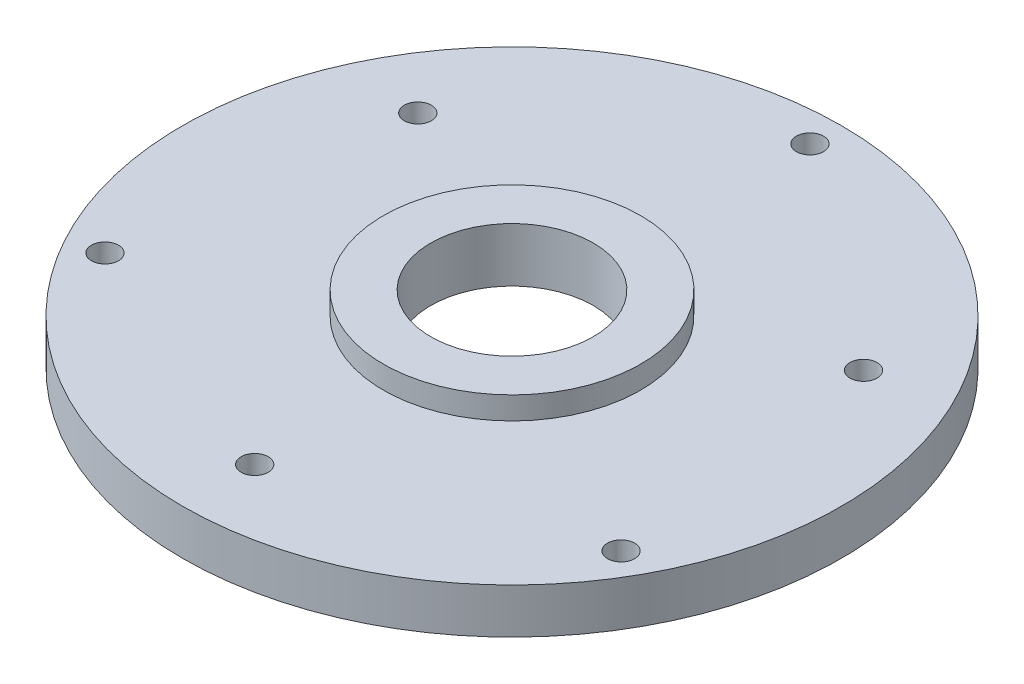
ISO-10303-21;
HEADER;
FILE_DESCRIPTION(('STEP AP214'),'2;1');
FILE_NAME('part.step','',(''),(''),'','','');
FILE_SCHEMA(('AUTOMOTIVE_DESIGN { 1 0 10303 214 1 1 1 1 }'));
ENDSEC;
DATA;
#1=APPLICATION_CONTEXT('core data for automotive mechanical design processes');
#2=APPLICATION_PROTOCOL_DEFINITION('international standard','automotive_design',2000,#1);
#3=PRODUCT_CONTEXT('',#1,'mechanical');
#4=PRODUCT('Part','Part','',(#3));
#5=PRODUCT_RELATED_PRODUCT_CATEGORY('part','',(#4));
#6=PRODUCT_DEFINITION_FORMATION('','',#4);
#7=PRODUCT_DEFINITION_CONTEXT('part definition',#1,'design');
#8=PRODUCT_DEFINITION('design','',#6,#7);
#9=PRODUCT_DEFINITION_SHAPE('','',#8);
#10=(LENGTH_UNIT() NAMED_UNIT(*) SI_UNIT(.MILLI.,.METRE.));
#11=(NAMED_UNIT(*) PLANE_ANGLE_UNIT() SI_UNIT($,.RADIAN.));
#12=(NAMED_UNIT(*) SI_UNIT($,.STERADIAN.) SOLID_ANGLE_UNIT());
#13=UNCERTAINTY_MEASURE_WITH_UNIT(LENGTH_MEASURE(1.E-05),#10,'distance_accuracy_value','');
#14=(GEOMETRIC_REPRESENTATION_CONTEXT(3) GLOBAL_UNCERTAINTY_ASSIGNED_CONTEXT((#13)) GLOBAL_UNIT_ASSIGNED_CONTEXT((#10,
#11,#12)) REPRESENTATION_CONTEXT('',''));
#15=CARTESIAN_POINT('',(0.,0.,0.));
#16=DIRECTION('',(0.,0.,1.));
#17=DIRECTION('',(1.,0.,0.));
#18=AXIS2_PLACEMENT_3D('',#15,#16,#17);
#19=CARTESIAN_POINT('',(0.,0.,0.));
#20=DIRECTION('',(0.,-1.,0.));
#21=DIRECTION('',(0.,0.,-1.));
#22=AXIS2_PLACEMENT_3D('',#19,#20,#21);
#23=CYLINDRICAL_SURFACE('',#22,14.25);
#24=CARTESIAN_POINT('',(0.,41.8859311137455,0.));
#25=DIRECTION('',(0.,-1.,0.));
#26=DIRECTION('',(0.,0.,-1.));
#27=AXIS2_PLACEMENT_3D('',#24,#25,#26);
#28=CIRCLE('',#27,14.25);
#29=CARTESIAN_POINT('',(0.,41.8859311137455,-14.25));
#30=VERTEX_POINT('',#29);
#31=EDGE_CURVE('E10',#30,#30,#28,.T.);
#32=ORIENTED_EDGE('',*,*,#31,.T.);
#33=EDGE_LOOP('',(#32));
#34=FACE_BOUND('',#33,.T.);
#35=CARTESIAN_POINT('',(0.,39.3859311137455,0.));
#36=DIRECTION('',(0.,-1.,0.));
#37=DIRECTION('',(0.,0.,-1.));
#38=AXIS2_PLACEMENT_3D('',#35,#36,#37);
#39=CIRCLE('',#38,14.25);
#40=CARTESIAN_POINT('',(0.,39.3859311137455,-14.25));
#41=VERTEX_POINT('',#40);
#42=EDGE_CURVE('E76',#41,#41,#39,.T.);
#43=ORIENTED_EDGE('',*,*,#42,.F.);
#44=EDGE_LOOP('',(#43));
#45=FACE_BOUND('',#44,.T.);
#46=ADVANCED_FACE('F39',(#34,#45),#23,.T.);
#47=CARTESIAN_POINT('',(9.,41.8859311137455,0.));
#48=DIRECTION('',(0.,1.,0.));
#49=DIRECTION('',(0.,0.,1.));
#50=AXIS2_PLACEMENT_3D('',#47,#48,#49);
#51=PLANE('',#50);
#52=CARTESIAN_POINT('',(0.,41.8859311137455,0.));
#53=DIRECTION('',(0.,-1.,0.));
#54=DIRECTION('',(0.,0.,-1.));
#55=AXIS2_PLACEMENT_3D('',#52,#53,#54);
#56=CIRCLE('',#55,9.);
#57=CARTESIAN_POINT('',(0.,41.8859311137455,-9.));
#58=VERTEX_POINT('',#57);
#59=EDGE_CURVE('E46',#58,#58,#56,.T.);
#60=ORIENTED_EDGE('',*,*,#59,.T.);
#61=EDGE_LOOP('',(#60));
#62=FACE_BOUND('',#61,.T.);
#63=ORIENTED_EDGE('',*,*,#31,.F.);
#64=EDGE_LOOP('',(#63));
#65=FACE_BOUND('',#64,.T.);
#66=ADVANCED_FACE('F109',(#62,#65),#51,.T.);
#67=CARTESIAN_POINT('',(0.,0.,0.));
#68=DIRECTION('',(0.,-1.,0.));
#69=DIRECTION('',(0.,0.,-1.));
#70=AXIS2_PLACEMENT_3D('',#67,#68,#69);
#71=CYLINDRICAL_SURFACE('',#70,9.);
#72=CARTESIAN_POINT('',(0.,35.8859311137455,0.));
#73=DIRECTION('',(0.,-1.,0.));
#74=DIRECTION('',(0.,0.,-1.));
#75=AXIS2_PLACEMENT_3D('',#72,#73,#74);
#76=CIRCLE('',#75,9.);
#77=CARTESIAN_POINT('',(0.,35.8859311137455,-9.));
#78=VERTEX_POINT('',#77);
#79=EDGE_CURVE('E51',#78,#78,#76,.T.);
#80=ORIENTED_EDGE('',*,*,#79,.T.);
#81=EDGE_LOOP('',(#80));
#82=FACE_BOUND('',#81,.T.);
#83=ORIENTED_EDGE('',*,*,#59,.F.);
#84=EDGE_LOOP('',(#83));
#85=FACE_BOUND('',#84,.T.);
#86=ADVANCED_FACE('F94',(#82,#85),#71,.F.);
#87=CARTESIAN_POINT('',(15.,35.8859311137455,0.));
#88=DIRECTION('',(0.,-1.,0.));
#89=DIRECTION('',(0.,0.,-1.));
#90=AXIS2_PLACEMENT_3D('',#87,#88,#89);
#91=PLANE('',#90);
#92=CARTESIAN_POINT('',(0.,35.8859311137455,0.));
#93=DIRECTION('',(0.,-1.,0.));
#94=DIRECTION('',(0.,0.,-1.));
#95=AXIS2_PLACEMENT_3D('',#92,#93,#94);
#96=CIRCLE('',#95,15.);
#97=CARTESIAN_POINT('',(0.,35.8859311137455,-15.));
#98=VERTEX_POINT('',#97);
#99=EDGE_CURVE('E89',#98,#98,#96,.T.);
#100=ORIENTED_EDGE('',*,*,#99,.T.);
#101=EDGE_LOOP('',(#100));
#102=FACE_BOUND('',#101,.T.);
#103=ORIENTED_EDGE('',*,*,#79,.F.);
#104=EDGE_LOOP('',(#103));
#105=FACE_BOUND('',#104,.T.);
#106=ADVANCED_FACE('F97',(#102,#105),#91,.T.);
#107=CARTESIAN_POINT('',(0.,0.,0.));
#108=DIRECTION('',(0.,-1.,0.));
#109=DIRECTION('',(0.,0.,-1.));
#110=AXIS2_PLACEMENT_3D('',#107,#108,#109);
#111=CYLINDRICAL_SURFACE('',#110,15.);
#112=CARTESIAN_POINT('',(0.,34.3859311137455,0.));
#113=DIRECTION('',(0.,-1.,0.));
#114=DIRECTION('',(0.,0.,-1.));
#115=AXIS2_PLACEMENT_3D('',#112,#113,#114);
#116=CIRCLE('',#115,15.);
#117=CARTESIAN_POINT('',(0.,34.3859311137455,-15.));
#118=VERTEX_POINT('',#117);
#119=EDGE_CURVE('E86',#118,#118,#116,.T.);
#120=ORIENTED_EDGE('',*,*,#119,.T.);
#121=EDGE_LOOP('',(#120));
#122=FACE_BOUND('',#121,.T.);
#123=ORIENTED_EDGE('',*,*,#99,.F.);
#124=EDGE_LOOP('',(#123));
#125=FACE_BOUND('',#124,.T.);
#126=ADVANCED_FACE('F99',(#122,#125),#111,.F.);
#127=CARTESIAN_POINT('',(15.,34.3859311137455,0.));
#128=DIRECTION('',(0.,-1.,0.));
#129=DIRECTION('',(0.,0.,-1.));
#130=AXIS2_PLACEMENT_3D('',#127,#128,#129);
#131=PLANE('',#130);
#132=CARTESIAN_POINT('',(0.,34.3859311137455,28.5));
#133=DIRECTION('',(0.,-1.,0.));
#134=DIRECTION('',(0.,0.,-1.));
#135=AXIS2_PLACEMENT_3D('',#132,#133,#134);
#136=CIRCLE('',#135,1.5);
#137=CARTESIAN_POINT('',(0.,34.3859311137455,27.));
#138=VERTEX_POINT('',#137);
#139=EDGE_CURVE('E58',#138,#138,#136,.T.);
#140=ORIENTED_EDGE('',*,*,#139,.F.);
#141=EDGE_LOOP('',(#140));
#142=FACE_BOUND('',#141,.T.);
#143=CARTESIAN_POINT('',(24.6817240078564,34.3859311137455,-14.2500000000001));
#144=DIRECTION('',(0.,-1.,0.));
#145=DIRECTION('',(0.,0.,-1.));
#146=AXIS2_PLACEMENT_3D('',#143,#144,#145);
#147=CIRCLE('',#146,1.5);
#148=CARTESIAN_POINT('',(24.6817240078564,34.3859311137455,-15.7500000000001));
#149=VERTEX_POINT('',#148);
#150=EDGE_CURVE('E169',#149,#149,#147,.T.);
#151=ORIENTED_EDGE('',*,*,#150,.F.);
#152=EDGE_LOOP('',(#151));
#153=FACE_BOUND('',#152,.T.);
#154=CARTESIAN_POINT('',(-24.6817240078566,34.3859311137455,-14.2499999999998));
#155=DIRECTION('',(0.,-1.,0.));
#156=DIRECTION('',(0.,0.,-1.));
#157=AXIS2_PLACEMENT_3D('',#154,#155,#156);
#158=CIRCLE('',#157,1.5);
#159=CARTESIAN_POINT('',(-24.6817240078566,34.3859311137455,-15.7499999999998));
#160=VERTEX_POINT('',#159);
#161=EDGE_CURVE('E172',#160,#160,#158,.T.);
#162=ORIENTED_EDGE('',*,*,#161,.F.);
#163=EDGE_LOOP('',(#162));
#164=FACE_BOUND('',#163,.T.);
#165=CARTESIAN_POINT('',(0.,34.3859311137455,-33.));
#166=DIRECTION('',(0.,1.,0.));
#167=DIRECTION('',(0.,0.,1.));
#168=AXIS2_PLACEMENT_3D('',#165,#166,#167);
#169=CIRCLE('',#168,1.5);
#170=CARTESIAN_POINT('',(0.,34.3859311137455,-31.5));
#171=VERTEX_POINT('',#170);
#172=EDGE_CURVE('E80',#171,#171,#169,.T.);
#173=ORIENTED_EDGE('',*,*,#172,.T.);
#174=EDGE_LOOP('',(#173));
#175=FACE_BOUND('',#174,.T.);
#176=CARTESIAN_POINT('',(28.5788383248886,34.3859311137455,16.4999999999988));
#177=DIRECTION('',(0.,1.,0.));
#178=DIRECTION('',(0.,0.,1.));
#179=AXIS2_PLACEMENT_3D('',#176,#177,#178);
#180=CIRCLE('',#179,1.5000000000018);
#181=CARTESIAN_POINT('',(28.5788383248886,34.3859311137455,18.0000000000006));
#182=VERTEX_POINT('',#181);
#183=EDGE_CURVE('E182',#182,#182,#180,.T.);
#184=ORIENTED_EDGE('',*,*,#183,.T.);
#185=EDGE_LOOP('',(#184));
#186=FACE_BOUND('',#185,.T.);
#187=CARTESIAN_POINT('',(-28.5788383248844,34.3859311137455,16.5000000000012));
#188=DIRECTION('',(0.,1.,0.));
#189=DIRECTION('',(0.,0.,1.));
#190=AXIS2_PLACEMENT_3D('',#187,#188,#189);
#191=CIRCLE('',#190,1.50000000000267);
#192=CARTESIAN_POINT('',(-28.5788383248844,34.3859311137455,18.0000000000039));
#193=VERTEX_POINT('',#192);
#194=EDGE_CURVE('E67',#193,#193,#191,.T.);
#195=ORIENTED_EDGE('',*,*,#194,.T.);
#196=EDGE_LOOP('',(#195));
#197=FACE_BOUND('',#196,.T.);
#198=CARTESIAN_POINT('',(0.,34.3859311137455,0.));
#199=DIRECTION('',(0.,-1.,0.));
#200=DIRECTION('',(0.,0.,-1.));
#201=AXIS2_PLACEMENT_3D('',#198,#199,#200);
#202=CIRCLE('',#201,36.5);
#203=CARTESIAN_POINT('',(0.,34.3859311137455,-36.5));
#204=VERTEX_POINT('',#203);
#205=EDGE_CURVE('E83',#204,#204,#202,.T.);
#206=ORIENTED_EDGE('',*,*,#205,.T.);
#207=EDGE_LOOP('',(#206));
#208=FACE_BOUND('',#207,.T.);
#209=ORIENTED_EDGE('',*,*,#119,.F.);
#210=EDGE_LOOP('',(#209));
#211=FACE_BOUND('',#210,.T.);
#212=ADVANCED_FACE('F106',(#142,#153,#164,#175,#186,#197,#208,#211),#131,.T.);
#213=CARTESIAN_POINT('',(0.,0.,0.));
#214=DIRECTION('',(0.,-1.,0.));
#215=DIRECTION('',(0.,0.,-1.));
#216=AXIS2_PLACEMENT_3D('',#213,#214,#215);
#217=CYLINDRICAL_SURFACE('',#216,36.5);
#218=CARTESIAN_POINT('',(0.,39.3859311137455,0.));
#219=DIRECTION('',(0.,-1.,0.));
#220=DIRECTION('',(0.,0.,-1.));
#221=AXIS2_PLACEMENT_3D('',#218,#219,#220);
#222=CIRCLE('',#221,36.5);
#223=CARTESIAN_POINT('',(0.,39.3859311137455,-36.5));
#224=VERTEX_POINT('',#223);
#225=EDGE_CURVE('E79',#224,#224,#222,.T.);
#226=ORIENTED_EDGE('',*,*,#225,.T.);
#227=EDGE_LOOP('',(#226));
#228=FACE_BOUND('',#227,.T.);
#229=ORIENTED_EDGE('',*,*,#205,.F.);
#230=EDGE_LOOP('',(#229));
#231=FACE_BOUND('',#230,.T.);
#232=ADVANCED_FACE('F123',(#228,#231),#217,.T.);
#233=CARTESIAN_POINT('',(14.25,39.3859311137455,0.));
#234=DIRECTION('',(0.,1.,0.));
#235=DIRECTION('',(0.,0.,1.));
#236=AXIS2_PLACEMENT_3D('',#233,#234,#235);
#237=PLANE('',#236);
#238=CARTESIAN_POINT('',(0.,39.3859311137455,28.5));
#239=DIRECTION('',(0.,1.,0.));
#240=DIRECTION('',(0.,0.,1.));
#241=AXIS2_PLACEMENT_3D('',#238,#239,#240);
#242=CIRCLE('',#241,1.5);
#243=CARTESIAN_POINT('',(0.,39.3859311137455,30.));
#244=VERTEX_POINT('',#243);
#245=EDGE_CURVE('E42',#244,#244,#242,.T.);
#246=ORIENTED_EDGE('',*,*,#245,.F.);
#247=EDGE_LOOP('',(#246));
#248=FACE_BOUND('',#247,.T.);
#249=CARTESIAN_POINT('',(24.6817240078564,39.3859311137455,-14.2500000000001));
#250=DIRECTION('',(0.,1.,0.));
#251=DIRECTION('',(0.,0.,1.));
#252=AXIS2_PLACEMENT_3D('',#249,#250,#251);
#253=CIRCLE('',#252,1.5);
#254=CARTESIAN_POINT('',(24.6817240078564,39.3859311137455,-12.7500000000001));
#255=VERTEX_POINT('',#254);
#256=EDGE_CURVE('E57',#255,#255,#253,.T.);
#257=ORIENTED_EDGE('',*,*,#256,.F.);
#258=EDGE_LOOP('',(#257));
#259=FACE_BOUND('',#258,.T.);
#260=CARTESIAN_POINT('',(-24.6817240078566,39.3859311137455,-14.2499999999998));
#261=DIRECTION('',(0.,1.,0.));
#262=DIRECTION('',(0.,0.,1.));
#263=AXIS2_PLACEMENT_3D('',#260,#261,#262);
#264=CIRCLE('',#263,1.5);
#265=CARTESIAN_POINT('',(-24.6817240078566,39.3859311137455,-12.7499999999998));
#266=VERTEX_POINT('',#265);
#267=EDGE_CURVE('E55',#266,#266,#264,.T.);
#268=ORIENTED_EDGE('',*,*,#267,.F.);
#269=EDGE_LOOP('',(#268));
#270=FACE_BOUND('',#269,.T.);
#271=CARTESIAN_POINT('',(0.,39.3859311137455,-33.));
#272=DIRECTION('',(0.,1.,0.));
#273=DIRECTION('',(0.,0.,1.));
#274=AXIS2_PLACEMENT_3D('',#271,#272,#273);
#275=CIRCLE('',#274,1.5);
#276=CARTESIAN_POINT('',(0.,39.3859311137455,-31.5));
#277=VERTEX_POINT('',#276);
#278=EDGE_CURVE('E179',#277,#277,#275,.T.);
#279=ORIENTED_EDGE('',*,*,#278,.F.);
#280=EDGE_LOOP('',(#279));
#281=FACE_BOUND('',#280,.T.);
#282=CARTESIAN_POINT('',(28.5788383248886,39.3859311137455,16.4999999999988));
#283=DIRECTION('',(0.,1.,0.));
#284=DIRECTION('',(0.,0.,1.));
#285=AXIS2_PLACEMENT_3D('',#282,#283,#284);
#286=CIRCLE('',#285,1.5000000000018);
#287=CARTESIAN_POINT('',(28.5788383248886,39.3859311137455,18.0000000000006));
#288=VERTEX_POINT('',#287);
#289=EDGE_CURVE('E72',#288,#288,#286,.T.);
#290=ORIENTED_EDGE('',*,*,#289,.F.);
#291=EDGE_LOOP('',(#290));
#292=FACE_BOUND('',#291,.T.);
#293=CARTESIAN_POINT('',(-28.5788383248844,39.3859311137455,16.5000000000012));
#294=DIRECTION('',(0.,1.,0.));
#295=DIRECTION('',(0.,0.,1.));
#296=AXIS2_PLACEMENT_3D('',#293,#294,#295);
#297=CIRCLE('',#296,1.50000000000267);
#298=CARTESIAN_POINT('',(-28.5788383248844,39.3859311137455,18.0000000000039));
#299=VERTEX_POINT('',#298);
#300=EDGE_CURVE('E63',#299,#299,#297,.T.);
#301=ORIENTED_EDGE('',*,*,#300,.F.);
#302=EDGE_LOOP('',(#301));
#303=FACE_BOUND('',#302,.T.);
#304=ORIENTED_EDGE('',*,*,#42,.T.);
#305=EDGE_LOOP('',(#304));
#306=FACE_BOUND('',#305,.T.);
#307=ORIENTED_EDGE('',*,*,#225,.F.);
#308=EDGE_LOOP('',(#307));
#309=FACE_BOUND('',#308,.T.);
#310=ADVANCED_FACE('F119',(#248,#259,#270,#281,#292,#303,#306,#309),#237,.T.);
#311=CARTESIAN_POINT('',(-28.5788383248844,34.3859311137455,16.5000000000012));
#312=DIRECTION('',(0.,1.,0.));
#313=DIRECTION('',(0.,0.,1.));
#314=AXIS2_PLACEMENT_3D('',#311,#312,#313);
#315=CYLINDRICAL_SURFACE('',#314,1.50000000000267);
#316=ORIENTED_EDGE('',*,*,#194,.F.);
#317=EDGE_LOOP('',(#316));
#318=FACE_BOUND('',#317,.T.);
#319=ORIENTED_EDGE('',*,*,#300,.T.);
#320=EDGE_LOOP('',(#319));
#321=FACE_BOUND('',#320,.T.);
#322=ADVANCED_FACE('F122',(#318,#321),#315,.F.);
#323=CARTESIAN_POINT('',(28.5788383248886,34.3859311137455,16.4999999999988));
#324=DIRECTION('',(0.,1.,0.));
#325=DIRECTION('',(0.,0.,1.));
#326=AXIS2_PLACEMENT_3D('',#323,#324,#325);
#327=CYLINDRICAL_SURFACE('',#326,1.5000000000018);
#328=ORIENTED_EDGE('',*,*,#183,.F.);
#329=EDGE_LOOP('',(#328));
#330=FACE_BOUND('',#329,.T.);
#331=ORIENTED_EDGE('',*,*,#289,.T.);
#332=EDGE_LOOP('',(#331));
#333=FACE_BOUND('',#332,.T.);
#334=ADVANCED_FACE('F147',(#330,#333),#327,.F.);
#335=CARTESIAN_POINT('',(0.,34.3859311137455,-33.));
#336=DIRECTION('',(0.,1.,0.));
#337=DIRECTION('',(0.,0.,1.));
#338=AXIS2_PLACEMENT_3D('',#335,#336,#337);
#339=CYLINDRICAL_SURFACE('',#338,1.5);
#340=ORIENTED_EDGE('',*,*,#172,.F.);
#341=EDGE_LOOP('',(#340));
#342=FACE_BOUND('',#341,.T.);
#343=ORIENTED_EDGE('',*,*,#278,.T.);
#344=EDGE_LOOP('',(#343));
#345=FACE_BOUND('',#344,.T.);
#346=ADVANCED_FACE('F151',(#342,#345),#339,.F.);
#347=CARTESIAN_POINT('',(-24.6817240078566,41.8859311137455,-14.2499999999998));
#348=DIRECTION('',(0.,-1.,0.));
#349=DIRECTION('',(0.,0.,-1.));
#350=AXIS2_PLACEMENT_3D('',#347,#348,#349);
#351=CYLINDRICAL_SURFACE('',#350,1.5);
#352=ORIENTED_EDGE('',*,*,#267,.T.);
#353=EDGE_LOOP('',(#352));
#354=FACE_BOUND('',#353,.T.);
#355=ORIENTED_EDGE('',*,*,#161,.T.);
#356=EDGE_LOOP('',(#355));
#357=FACE_BOUND('',#356,.T.);
#358=ADVANCED_FACE('F155',(#354,#357),#351,.F.);
#359=CARTESIAN_POINT('',(24.6817240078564,41.8859311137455,-14.2500000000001));
#360=DIRECTION('',(0.,-1.,0.));
#361=DIRECTION('',(0.,0.,-1.));
#362=AXIS2_PLACEMENT_3D('',#359,#360,#361);
#363=CYLINDRICAL_SURFACE('',#362,1.5);
#364=ORIENTED_EDGE('',*,*,#256,.T.);
#365=EDGE_LOOP('',(#364));
#366=FACE_BOUND('',#365,.T.);
#367=ORIENTED_EDGE('',*,*,#150,.T.);
#368=EDGE_LOOP('',(#367));
#369=FACE_BOUND('',#368,.T.);
#370=ADVANCED_FACE('F159',(#366,#369),#363,.F.);
#371=CARTESIAN_POINT('',(0.,41.8859311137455,28.5));
#372=DIRECTION('',(0.,-1.,0.));
#373=DIRECTION('',(0.,0.,-1.));
#374=AXIS2_PLACEMENT_3D('',#371,#372,#373);
#375=CYLINDRICAL_SURFACE('',#374,1.5);
#376=ORIENTED_EDGE('',*,*,#245,.T.);
#377=EDGE_LOOP('',(#376));
#378=FACE_BOUND('',#377,.T.);
#379=ORIENTED_EDGE('',*,*,#139,.T.);
#380=EDGE_LOOP('',(#379));
#381=FACE_BOUND('',#380,.T.);
#382=ADVANCED_FACE('F163',(#378,#381),#375,.F.);
#383=CLOSED_SHELL('',(#46,#66,#86,#106,#126,#212,#232,#310,#322,#334,#346,#358,#370,#382));
#384=MANIFOLD_SOLID_BREP('B2',#383);
#385=ADVANCED_BREP_SHAPE_REPRESENTATION('',(#18,#384),#14);
#386=SHAPE_DEFINITION_REPRESENTATION(#9,#385);
ENDSEC;
END-ISO-10303-21;
